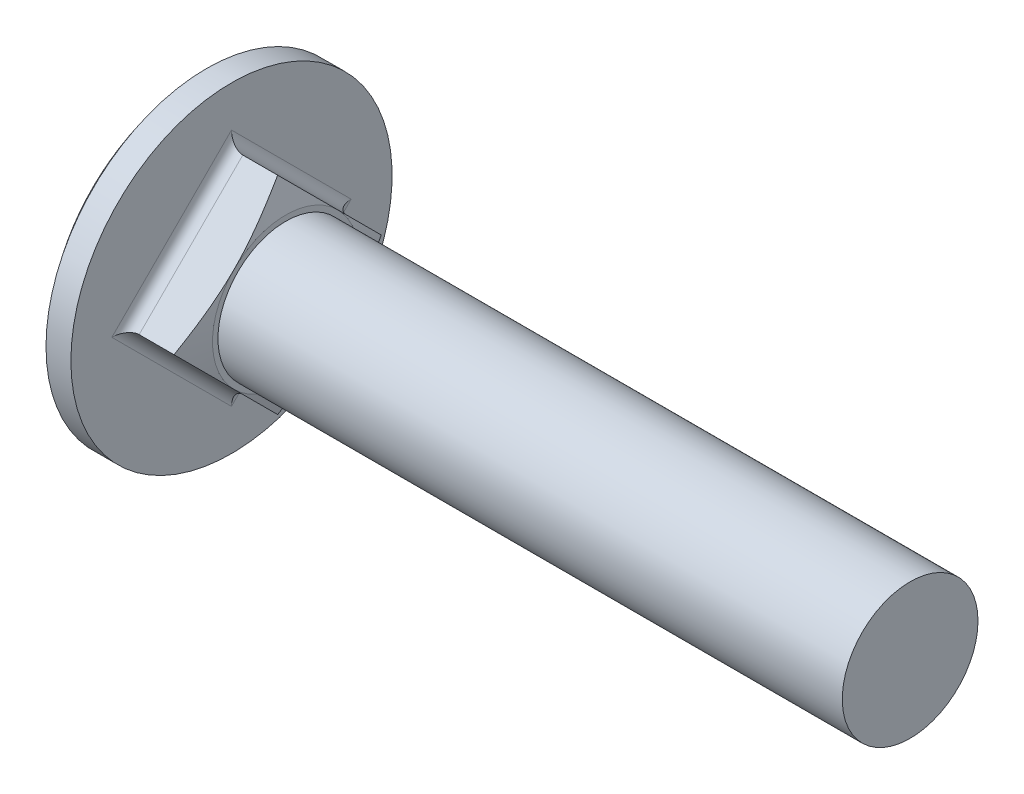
from build123d import *

# Parameters (mm, degrees)
NECK_DEPTH     = 2.4
SKETCH5_R      = 3
BASEBODY_DEPTH = 30
FILLET1_R      = 0.5


with BuildPart() as part:
    # Sketch2 → BaseHead (revolve)
    with BuildSketch(Plane.XY, mode=Mode.PRIVATE) as basehead_sk:
        with BuildLine():
            Line((3.6, 0), (3.6, 7.1))
            Line((3.6, 7.1), (2.5, 7.1))
            ThreePointArc((2.5, 7.1), (0.643257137, 3.763641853), (0, 0))
            Line((0, 0), (3.6, 0))
        make_face()
    revolve(basehead_sk.sketch.rotate(Axis((-6.266821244, 0, 0), (1, 0, 0)), 90), axis=Axis((-6.266821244, 0, 0), (1, 0, 0)))

    # Sketch3 → Neck (add)
    with BuildSketch(Plane(origin=(3.6, 0, 0), x_dir=(0, 0, -1), z_dir=(1, 0, 0))):
        Polygon((4.582051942, 0), (0, 4.582051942), (-4.582051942, 0), (0, -4.582051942), align=None)
    extrude(amount=NECK_DEPTH)

    # Sketch4 → Cut-Extrude1 (revolve, cut)
    with BuildSketch(Plane.XY):
        Polygon((6, 4.582051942), (6, 3.24), (5.640398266, 4.582051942), align=None)
    revolve(axis=Axis((2.984818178, 0, 0), (1, 0, 0)), mode=Mode.SUBTRACT)

    # Sketch5 → BaseBody (add)
    with BuildSketch(Plane(origin=(3.6, 0, 0), x_dir=(0, 0, -1), z_dir=(1, 0, 0))):
        Circle(SKETCH5_R)
    extrude(amount=BASEBODY_DEPTH)

    # Fillet1
    fillet1_edges = [part.edges().sort_by_distance(p)[0] for p in [
        (3.6, -2.291025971, -2.291025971),
        (3.6, 2.291025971, -2.291025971),
        (3.6, 2.291025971, 2.291025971),
        (3.6, -2.291025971, 2.291025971),
    ]]
    fillet(fillet1_edges, radius=FILLET1_R)


solid = part.part
